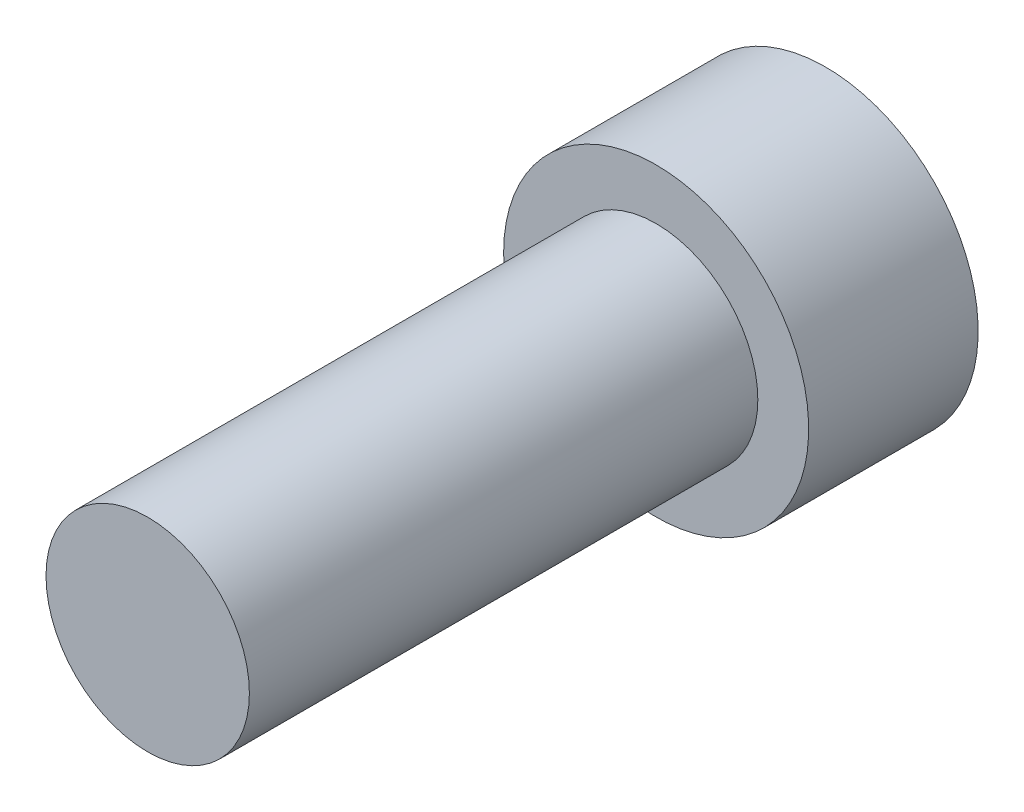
from build123d import *

# Parameters (mm, degrees)
ESQUISSE1_R                  = 3
BASE_EXTRUSION_DEPTH         = 15
ESQUISSE2_R                  = 4.5
BOSS_EXTRU_1_DEPTH           = 5
ENL_V_MAT_EXTRU_3_DEPTH      = 4
R_P_TITION_CIRCULAIRE1_COUNT = 6


with BuildPart() as part:
    # Esquisse1 → Base-Extrusion (new body)
    with BuildSketch(Plane.XY):
        Circle(ESQUISSE1_R)
    extrude(amount=BASE_EXTRUSION_DEPTH)

    # Esquisse2 → Boss.-Extru.1 (add)
    with BuildSketch(Plane(origin=(0, 0, 0), x_dir=(-1, 0, 0), z_dir=(0, 0, -1))):
        Circle(ESQUISSE2_R)
    extrude(amount=BOSS_EXTRU_1_DEPTH)

    # Esquisse3 → Enl_v. mat.-Extru.3 (cut)
    with BuildSketch(Plane(origin=(0, 0, -5), x_dir=(-1, 0, 0), z_dir=(0, 0, -1))):
        Polygon((3, 1.732050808), (0, 0), (3, -1.732050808), align=None)
    enl_v_mat_extru_3 = extrude(amount=-ENL_V_MAT_EXTRU_3_DEPTH, mode=Mode.SUBTRACT)

    # R_p_tition circulaire1: Enl_v. mat.-Extru.3 ×6 about axis
    r_p_tition_circulaire1_axis = Axis((0, 0, 0), (0, 0, 1))
    for i in range(1, R_P_TITION_CIRCULAIRE1_COUNT):
        add(enl_v_mat_extru_3.rotate(r_p_tition_circulaire1_axis, i * 360 / R_P_TITION_CIRCULAIRE1_COUNT), mode=Mode.SUBTRACT)


solid = part.part
